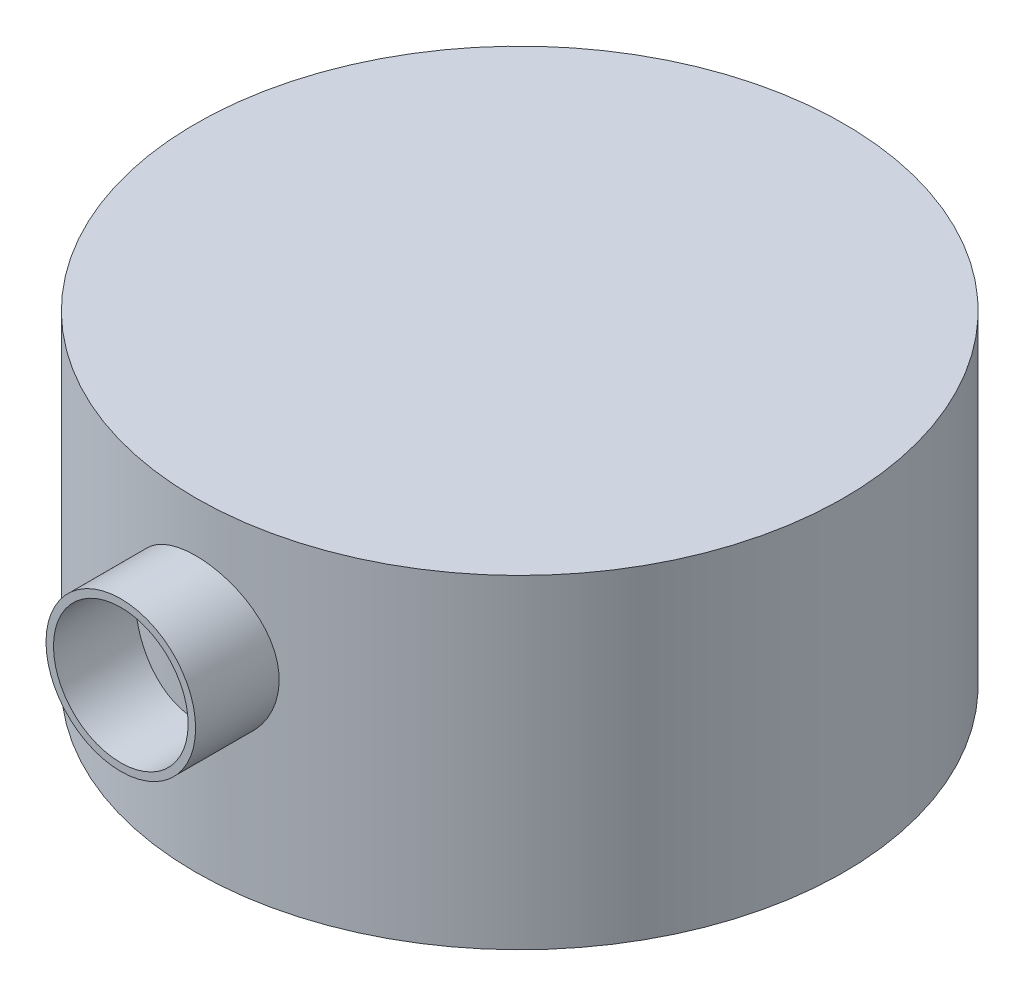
from build123d import *

# Parameters (mm, degrees)
ESQUISSE1_R      = 65
EXTRUSION1_DEPTH = 65
ESQUISSE2_R      = 15
ESQUISSE2_R_2    = 13.5
EXTRUSION2_DEPTH = 80


with BuildPart() as part:
    # Esquisse1 → Extrusion1 (new body)
    with BuildSketch(Plane(origin=(0, 0, 0), x_dir=(1, 0, 0), z_dir=(0, 1, 0))):
        with Locations(Location((0, 0, 0), (0, 0, 270))):
            Circle(ESQUISSE1_R)
    extrude(amount=EXTRUSION1_DEPTH)

    # Esquisse2 → Extrusion2 (add)
    with BuildSketch(Plane.XY):
        with Locations(Location((0, 40, 0), (0, 0, 180))):
            Circle(ESQUISSE2_R)
        with Locations(Location((0, 40, 0), (0, 0, 180))):
            Circle(ESQUISSE2_R_2, mode=Mode.SUBTRACT)
    extrude(amount=EXTRUSION2_DEPTH)


solid = part.part
